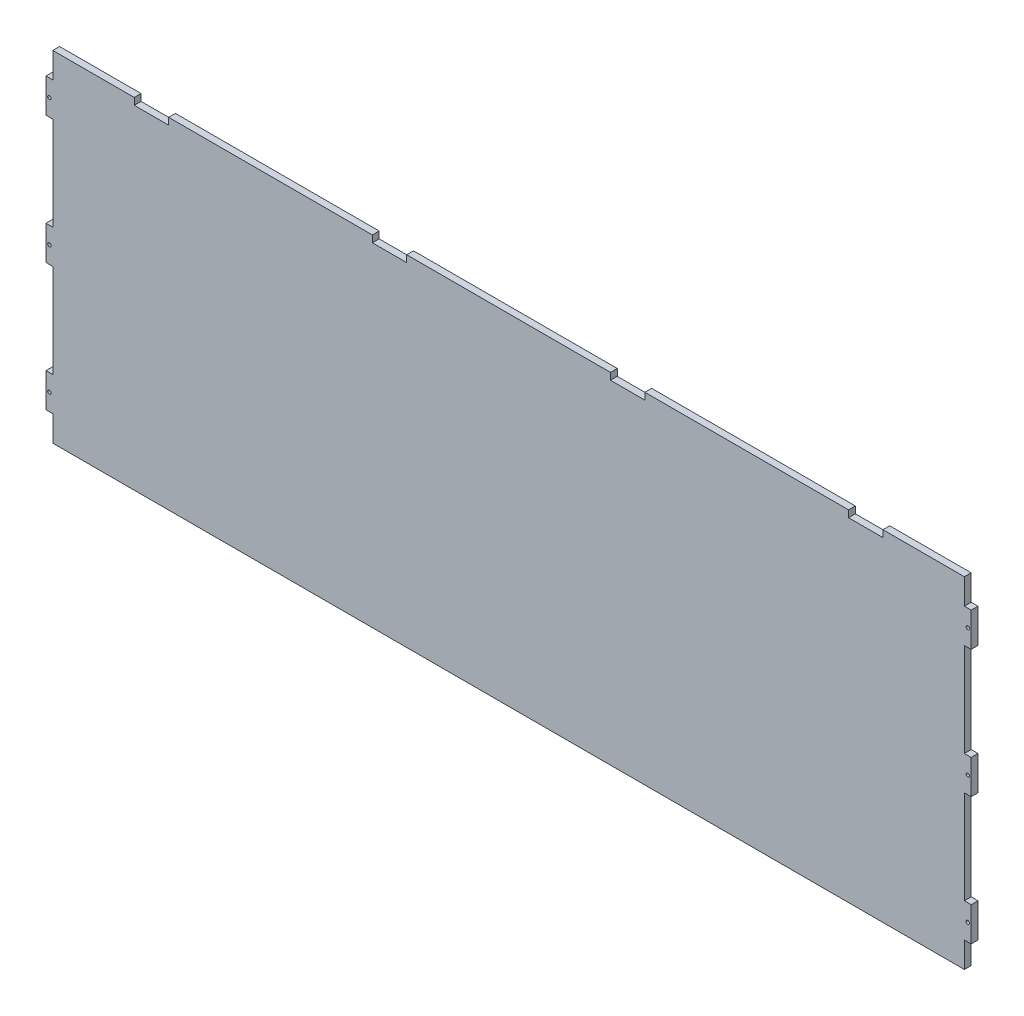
ISO-10303-21;
HEADER;
FILE_DESCRIPTION(('STEP AP214'),'2;1');
FILE_NAME('part.step','',(''),(''),'','','');
FILE_SCHEMA(('AUTOMOTIVE_DESIGN { 1 0 10303 214 1 1 1 1 }'));
ENDSEC;
DATA;
#1=APPLICATION_CONTEXT('core data for automotive mechanical design processes');
#2=APPLICATION_PROTOCOL_DEFINITION('international standard','automotive_design',2000,#1);
#3=PRODUCT_CONTEXT('',#1,'mechanical');
#4=PRODUCT('Part','Part','',(#3));
#5=PRODUCT_RELATED_PRODUCT_CATEGORY('part','',(#4));
#6=PRODUCT_DEFINITION_FORMATION('','',#4);
#7=PRODUCT_DEFINITION_CONTEXT('part definition',#1,'design');
#8=PRODUCT_DEFINITION('design','',#6,#7);
#9=PRODUCT_DEFINITION_SHAPE('','',#8);
#10=(LENGTH_UNIT() NAMED_UNIT(*) SI_UNIT(.MILLI.,.METRE.));
#11=(NAMED_UNIT(*) PLANE_ANGLE_UNIT() SI_UNIT($,.RADIAN.));
#12=(NAMED_UNIT(*) SI_UNIT($,.STERADIAN.) SOLID_ANGLE_UNIT());
#13=UNCERTAINTY_MEASURE_WITH_UNIT(LENGTH_MEASURE(1.E-05),#10,'distance_accuracy_value','');
#14=(GEOMETRIC_REPRESENTATION_CONTEXT(3) GLOBAL_UNCERTAINTY_ASSIGNED_CONTEXT((#13)) GLOBAL_UNIT_ASSIGNED_CONTEXT((#10,
#11,#12)) REPRESENTATION_CONTEXT('',''));
#15=CARTESIAN_POINT('',(0.,0.,0.));
#16=DIRECTION('',(0.,0.,1.));
#17=DIRECTION('',(1.,0.,0.));
#18=AXIS2_PLACEMENT_3D('',#15,#16,#17);
#19=CARTESIAN_POINT('',(-272.,100.,4.));
#20=DIRECTION('',(0.,-1.,0.));
#21=DIRECTION('',(0.,0.,-1.));
#22=AXIS2_PLACEMENT_3D('',#19,#20,#21);
#23=PLANE('',#22);
#24=DIRECTION('',(-1.,0.,0.));
#25=VECTOR('',#24,1.);
#26=CARTESIAN_POINT('',(-272.,100.,4.));
#27=LINE('',#26,#25);
#28=CARTESIAN_POINT('',(-220.1,100.,4.));
#29=VERTEX_POINT('',#28);
#30=CARTESIAN_POINT('',(-268.,100.,4.));
#31=VERTEX_POINT('',#30);
#32=EDGE_CURVE('E732',#29,#31,#27,.T.);
#33=ORIENTED_EDGE('',*,*,#32,.F.);
#34=DIRECTION('',(0.,0.,1.));
#35=VECTOR('',#34,1.);
#36=CARTESIAN_POINT('',(-220.1,100.,0.));
#37=LINE('',#36,#35);
#38=CARTESIAN_POINT('',(-220.1,100.,0.));
#39=VERTEX_POINT('',#38);
#40=EDGE_CURVE('E362',#39,#29,#37,.T.);
#41=ORIENTED_EDGE('',*,*,#40,.F.);
#42=DIRECTION('',(-1.,0.,0.));
#43=VECTOR('',#42,1.);
#44=CARTESIAN_POINT('',(-272.,100.,0.));
#45=LINE('',#44,#43);
#46=CARTESIAN_POINT('',(-268.,100.,0.));
#47=VERTEX_POINT('',#46);
#48=EDGE_CURVE('E343',#39,#47,#45,.T.);
#49=ORIENTED_EDGE('',*,*,#48,.T.);
#50=DIRECTION('',(0.,0.,1.));
#51=VECTOR('',#50,1.);
#52=CARTESIAN_POINT('',(-268.,100.,0.));
#53=LINE('',#52,#51);
#54=EDGE_CURVE('E494',#47,#31,#53,.T.);
#55=ORIENTED_EDGE('',*,*,#54,.T.);
#56=EDGE_LOOP('',(#33,#41,#49,#55));
#57=FACE_BOUND('',#56,.T.);
#58=ADVANCED_FACE('F38',(#57),#23,.F.);
#59=CARTESIAN_POINT('',(-80.1,100.,0.));
#60=VERTEX_POINT('',#59);
#61=CARTESIAN_POINT('',(-199.9,100.,0.));
#62=VERTEX_POINT('',#61);
#63=EDGE_CURVE('E871',#60,#62,#45,.T.);
#64=ORIENTED_EDGE('',*,*,#63,.T.);
#65=DIRECTION('',(0.,0.,1.));
#66=VECTOR('',#65,1.);
#67=CARTESIAN_POINT('',(-199.9,100.,0.));
#68=LINE('',#67,#66);
#69=CARTESIAN_POINT('',(-199.9,100.,4.));
#70=VERTEX_POINT('',#69);
#71=EDGE_CURVE('E366',#62,#70,#68,.T.);
#72=ORIENTED_EDGE('',*,*,#71,.T.);
#73=CARTESIAN_POINT('',(-80.1,100.,4.));
#74=VERTEX_POINT('',#73);
#75=EDGE_CURVE('E792',#74,#70,#27,.T.);
#76=ORIENTED_EDGE('',*,*,#75,.F.);
#77=DIRECTION('',(0.,0.,1.));
#78=VECTOR('',#77,1.);
#79=CARTESIAN_POINT('',(-80.1,100.,0.));
#80=LINE('',#79,#78);
#81=EDGE_CURVE('E359',#60,#74,#80,.T.);
#82=ORIENTED_EDGE('',*,*,#81,.F.);
#83=EDGE_LOOP('',(#64,#72,#76,#82));
#84=FACE_BOUND('',#83,.T.);
#85=ADVANCED_FACE('F869',(#84),#23,.F.);
#86=CARTESIAN_POINT('',(59.9,100.,0.));
#87=VERTEX_POINT('',#86);
#88=CARTESIAN_POINT('',(-59.9,100.,0.));
#89=VERTEX_POINT('',#88);
#90=EDGE_CURVE('E874',#87,#89,#45,.T.);
#91=ORIENTED_EDGE('',*,*,#90,.T.);
#92=DIRECTION('',(0.,0.,1.));
#93=VECTOR('',#92,1.);
#94=CARTESIAN_POINT('',(-59.9,100.,0.));
#95=LINE('',#94,#93);
#96=CARTESIAN_POINT('',(-59.9,100.,4.));
#97=VERTEX_POINT('',#96);
#98=EDGE_CURVE('E397',#89,#97,#95,.T.);
#99=ORIENTED_EDGE('',*,*,#98,.T.);
#100=CARTESIAN_POINT('',(59.9,100.,4.));
#101=VERTEX_POINT('',#100);
#102=EDGE_CURVE('E851',#101,#97,#27,.T.);
#103=ORIENTED_EDGE('',*,*,#102,.F.);
#104=DIRECTION('',(0.,0.,1.));
#105=VECTOR('',#104,1.);
#106=CARTESIAN_POINT('',(59.9,100.,0.));
#107=LINE('',#106,#105);
#108=EDGE_CURVE('E389',#87,#101,#107,.T.);
#109=ORIENTED_EDGE('',*,*,#108,.F.);
#110=EDGE_LOOP('',(#91,#99,#103,#109));
#111=FACE_BOUND('',#110,.T.);
#112=ADVANCED_FACE('F1017',(#111),#23,.F.);
#113=CARTESIAN_POINT('',(199.9,100.,0.));
#114=VERTEX_POINT('',#113);
#115=CARTESIAN_POINT('',(80.1,100.,0.));
#116=VERTEX_POINT('',#115);
#117=EDGE_CURVE('E746',#114,#116,#45,.T.);
#118=ORIENTED_EDGE('',*,*,#117,.T.);
#119=DIRECTION('',(0.,0.,1.));
#120=VECTOR('',#119,1.);
#121=CARTESIAN_POINT('',(80.1,100.,0.));
#122=LINE('',#121,#120);
#123=CARTESIAN_POINT('',(80.1,100.,4.));
#124=VERTEX_POINT('',#123);
#125=EDGE_CURVE('E433',#116,#124,#122,.T.);
#126=ORIENTED_EDGE('',*,*,#125,.T.);
#127=CARTESIAN_POINT('',(199.9,100.,4.));
#128=VERTEX_POINT('',#127);
#129=EDGE_CURVE('E731',#128,#124,#27,.T.);
#130=ORIENTED_EDGE('',*,*,#129,.F.);
#131=DIRECTION('',(0.,0.,1.));
#132=VECTOR('',#131,1.);
#133=CARTESIAN_POINT('',(199.9,100.,0.));
#134=LINE('',#133,#132);
#135=EDGE_CURVE('E425',#114,#128,#134,.T.);
#136=ORIENTED_EDGE('',*,*,#135,.F.);
#137=EDGE_LOOP('',(#118,#126,#130,#136));
#138=FACE_BOUND('',#137,.T.);
#139=ADVANCED_FACE('F848',(#138),#23,.F.);
#140=CARTESIAN_POINT('',(268.,100.,0.));
#141=VERTEX_POINT('',#140);
#142=CARTESIAN_POINT('',(220.1,100.,0.));
#143=VERTEX_POINT('',#142);
#144=EDGE_CURVE('E742',#141,#143,#45,.T.);
#145=ORIENTED_EDGE('',*,*,#144,.T.);
#146=DIRECTION('',(0.,0.,1.));
#147=VECTOR('',#146,1.);
#148=CARTESIAN_POINT('',(220.1,100.,0.));
#149=LINE('',#148,#147);
#150=CARTESIAN_POINT('',(220.1,100.,4.));
#151=VERTEX_POINT('',#150);
#152=EDGE_CURVE('E468',#143,#151,#149,.T.);
#153=ORIENTED_EDGE('',*,*,#152,.T.);
#154=CARTESIAN_POINT('',(268.,100.,4.));
#155=VERTEX_POINT('',#154);
#156=EDGE_CURVE('E726',#155,#151,#27,.T.);
#157=ORIENTED_EDGE('',*,*,#156,.F.);
#158=DIRECTION('',(0.,0.,1.));
#159=VECTOR('',#158,1.);
#160=CARTESIAN_POINT('',(268.,100.,0.));
#161=LINE('',#160,#159);
#162=EDGE_CURVE('E606',#141,#155,#161,.T.);
#163=ORIENTED_EDGE('',*,*,#162,.F.);
#164=EDGE_LOOP('',(#145,#153,#157,#163));
#165=FACE_BOUND('',#164,.T.);
#166=ADVANCED_FACE('F830',(#165),#23,.F.);
#167=CARTESIAN_POINT('',(-272.,-100.,4.));
#168=DIRECTION('',(1.,0.,0.));
#169=DIRECTION('',(0.,0.,-1.));
#170=AXIS2_PLACEMENT_3D('',#167,#168,#169);
#171=PLANE('',#170);
#172=DIRECTION('',(0.,0.,1.));
#173=VECTOR('',#172,1.);
#174=CARTESIAN_POINT('',(-272.,85.,0.));
#175=LINE('',#174,#173);
#176=CARTESIAN_POINT('',(-272.,85.,0.));
#177=VERTEX_POINT('',#176);
#178=CARTESIAN_POINT('',(-272.,85.,4.));
#179=VERTEX_POINT('',#178);
#180=EDGE_CURVE('E485',#177,#179,#175,.T.);
#181=ORIENTED_EDGE('',*,*,#180,.F.);
#182=DIRECTION('',(0.,-1.,0.));
#183=VECTOR('',#182,1.);
#184=CARTESIAN_POINT('',(-272.,-100.,0.));
#185=LINE('',#184,#183);
#186=CARTESIAN_POINT('',(-272.,65.,0.));
#187=VERTEX_POINT('',#186);
#188=EDGE_CURVE('E750',#177,#187,#185,.T.);
#189=ORIENTED_EDGE('',*,*,#188,.T.);
#190=DIRECTION('',(0.,0.,1.));
#191=VECTOR('',#190,1.);
#192=CARTESIAN_POINT('',(-272.,65.,0.));
#193=LINE('',#192,#191);
#194=CARTESIAN_POINT('',(-272.,65.,4.));
#195=VERTEX_POINT('',#194);
#196=EDGE_CURVE('E490',#187,#195,#193,.T.);
#197=ORIENTED_EDGE('',*,*,#196,.T.);
#198=DIRECTION('',(0.,-1.,0.));
#199=VECTOR('',#198,1.);
#200=CARTESIAN_POINT('',(-272.,-100.,4.));
#201=LINE('',#200,#199);
#202=EDGE_CURVE('E48',#179,#195,#201,.T.);
#203=ORIENTED_EDGE('',*,*,#202,.F.);
#204=EDGE_LOOP('',(#181,#189,#197,#203));
#205=FACE_BOUND('',#204,.T.);
#206=ADVANCED_FACE('F971',(#205),#171,.F.);
#207=DIRECTION('',(0.,0.,1.));
#208=VECTOR('',#207,1.);
#209=CARTESIAN_POINT('',(-272.,10.,0.));
#210=LINE('',#209,#208);
#211=CARTESIAN_POINT('',(-272.,10.,0.));
#212=VERTEX_POINT('',#211);
#213=CARTESIAN_POINT('',(-272.,10.,4.));
#214=VERTEX_POINT('',#213);
#215=EDGE_CURVE('E515',#212,#214,#210,.T.);
#216=ORIENTED_EDGE('',*,*,#215,.F.);
#217=CARTESIAN_POINT('',(-272.,-10.,0.));
#218=VERTEX_POINT('',#217);
#219=EDGE_CURVE('E749',#212,#218,#185,.T.);
#220=ORIENTED_EDGE('',*,*,#219,.T.);
#221=DIRECTION('',(0.,0.,1.));
#222=VECTOR('',#221,1.);
#223=CARTESIAN_POINT('',(-272.,-10.,0.));
#224=LINE('',#223,#222);
#225=CARTESIAN_POINT('',(-272.,-10.,4.));
#226=VERTEX_POINT('',#225);
#227=EDGE_CURVE('E521',#218,#226,#224,.T.);
#228=ORIENTED_EDGE('',*,*,#227,.T.);
#229=EDGE_CURVE('E735',#214,#226,#201,.T.);
#230=ORIENTED_EDGE('',*,*,#229,.F.);
#231=EDGE_LOOP('',(#216,#220,#228,#230));
#232=FACE_BOUND('',#231,.T.);
#233=ADVANCED_FACE('F982',(#232),#171,.F.);
#234=DIRECTION('',(0.,0.,1.));
#235=VECTOR('',#234,1.);
#236=CARTESIAN_POINT('',(-272.,-65.,0.));
#237=LINE('',#236,#235);
#238=CARTESIAN_POINT('',(-272.,-65.,0.));
#239=VERTEX_POINT('',#238);
#240=CARTESIAN_POINT('',(-272.,-65.,4.));
#241=VERTEX_POINT('',#240);
#242=EDGE_CURVE('E550',#239,#241,#237,.T.);
#243=ORIENTED_EDGE('',*,*,#242,.F.);
#244=CARTESIAN_POINT('',(-272.,-85.,0.));
#245=VERTEX_POINT('',#244);
#246=EDGE_CURVE('E745',#239,#245,#185,.T.);
#247=ORIENTED_EDGE('',*,*,#246,.T.);
#248=DIRECTION('',(0.,0.,1.));
#249=VECTOR('',#248,1.);
#250=CARTESIAN_POINT('',(-272.,-85.,0.));
#251=LINE('',#250,#249);
#252=CARTESIAN_POINT('',(-272.,-85.,4.));
#253=VERTEX_POINT('',#252);
#254=EDGE_CURVE('E556',#245,#253,#251,.T.);
#255=ORIENTED_EDGE('',*,*,#254,.T.);
#256=EDGE_CURVE('E730',#241,#253,#201,.T.);
#257=ORIENTED_EDGE('',*,*,#256,.F.);
#258=EDGE_LOOP('',(#243,#247,#255,#257));
#259=FACE_BOUND('',#258,.T.);
#260=ADVANCED_FACE('F997',(#259),#171,.F.);
#261=CARTESIAN_POINT('',(-272.,-100.,4.));
#262=DIRECTION('',(0.,1.,0.));
#263=DIRECTION('',(0.,0.,1.));
#264=AXIS2_PLACEMENT_3D('',#261,#262,#263);
#265=PLANE('',#264);
#266=DIRECTION('',(0.,0.,1.));
#267=VECTOR('',#266,1.);
#268=CARTESIAN_POINT('',(-268.,-100.,0.));
#269=LINE('',#268,#267);
#270=CARTESIAN_POINT('',(-268.,-100.,0.));
#271=VERTEX_POINT('',#270);
#272=CARTESIAN_POINT('',(-268.,-100.,4.));
#273=VERTEX_POINT('',#272);
#274=EDGE_CURVE('E582',#271,#273,#269,.T.);
#275=ORIENTED_EDGE('',*,*,#274,.F.);
#276=DIRECTION('',(1.,0.,0.));
#277=VECTOR('',#276,1.);
#278=CARTESIAN_POINT('',(-272.,-100.,0.));
#279=LINE('',#278,#277);
#280=CARTESIAN_POINT('',(268.,-100.,0.));
#281=VERTEX_POINT('',#280);
#282=EDGE_CURVE('E42',#271,#281,#279,.T.);
#283=ORIENTED_EDGE('',*,*,#282,.T.);
#284=DIRECTION('',(0.,0.,1.));
#285=VECTOR('',#284,1.);
#286=CARTESIAN_POINT('',(268.,-100.,0.));
#287=LINE('',#286,#285);
#288=CARTESIAN_POINT('',(268.,-100.,4.));
#289=VERTEX_POINT('',#288);
#290=EDGE_CURVE('E679',#281,#289,#287,.T.);
#291=ORIENTED_EDGE('',*,*,#290,.T.);
#292=DIRECTION('',(1.,0.,0.));
#293=VECTOR('',#292,1.);
#294=CARTESIAN_POINT('',(-272.,-100.,4.));
#295=LINE('',#294,#293);
#296=EDGE_CURVE('E11',#273,#289,#295,.T.);
#297=ORIENTED_EDGE('',*,*,#296,.F.);
#298=EDGE_LOOP('',(#275,#283,#291,#297));
#299=FACE_BOUND('',#298,.T.);
#300=ADVANCED_FACE('F769',(#299),#265,.F.);
#301=CARTESIAN_POINT('',(0.,0.,4.));
#302=DIRECTION('',(0.,0.,-1.));
#303=DIRECTION('',(-1.,0.,0.));
#304=AXIS2_PLACEMENT_3D('',#301,#302,#303);
#305=PLANE('',#304);
#306=CARTESIAN_POINT('',(-270.,75.,4.));
#307=DIRECTION('',(0.,0.,1.));
#308=DIRECTION('',(1.,0.,0.));
#309=AXIS2_PLACEMENT_3D('',#306,#307,#308);
#310=CIRCLE('',#309,1.);
#311=CARTESIAN_POINT('',(-269.,75.,4.));
#312=VERTEX_POINT('',#311);
#313=EDGE_CURVE('E1616',#312,#312,#310,.T.);
#314=ORIENTED_EDGE('',*,*,#313,.F.);
#315=EDGE_LOOP('',(#314));
#316=FACE_BOUND('',#315,.T.);
#317=CARTESIAN_POINT('',(-270.,0.,4.));
#318=DIRECTION('',(0.,0.,1.));
#319=DIRECTION('',(1.,0.,0.));
#320=AXIS2_PLACEMENT_3D('',#317,#318,#319);
#321=CIRCLE('',#320,1.);
#322=CARTESIAN_POINT('',(-269.,0.,4.));
#323=VERTEX_POINT('',#322);
#324=EDGE_CURVE('E1610',#323,#323,#321,.T.);
#325=ORIENTED_EDGE('',*,*,#324,.F.);
#326=EDGE_LOOP('',(#325));
#327=FACE_BOUND('',#326,.T.);
#328=CARTESIAN_POINT('',(-270.,-75.,4.));
#329=DIRECTION('',(0.,0.,1.));
#330=DIRECTION('',(1.,0.,0.));
#331=AXIS2_PLACEMENT_3D('',#328,#329,#330);
#332=CIRCLE('',#331,1.);
#333=CARTESIAN_POINT('',(-269.,-75.,4.));
#334=VERTEX_POINT('',#333);
#335=EDGE_CURVE('E1604',#334,#334,#332,.T.);
#336=ORIENTED_EDGE('',*,*,#335,.F.);
#337=EDGE_LOOP('',(#336));
#338=FACE_BOUND('',#337,.T.);
#339=CARTESIAN_POINT('',(270.,75.,4.));
#340=DIRECTION('',(0.,0.,1.));
#341=DIRECTION('',(1.,0.,0.));
#342=AXIS2_PLACEMENT_3D('',#339,#340,#341);
#343=CIRCLE('',#342,1.);
#344=CARTESIAN_POINT('',(271.,75.,4.));
#345=VERTEX_POINT('',#344);
#346=EDGE_CURVE('E1598',#345,#345,#343,.T.);
#347=ORIENTED_EDGE('',*,*,#346,.F.);
#348=EDGE_LOOP('',(#347));
#349=FACE_BOUND('',#348,.T.);
#350=CARTESIAN_POINT('',(270.,0.,4.));
#351=DIRECTION('',(0.,0.,1.));
#352=DIRECTION('',(1.,0.,0.));
#353=AXIS2_PLACEMENT_3D('',#350,#351,#352);
#354=CIRCLE('',#353,1.);
#355=CARTESIAN_POINT('',(271.,0.,4.));
#356=VERTEX_POINT('',#355);
#357=EDGE_CURVE('E1590',#356,#356,#354,.T.);
#358=ORIENTED_EDGE('',*,*,#357,.F.);
#359=EDGE_LOOP('',(#358));
#360=FACE_BOUND('',#359,.T.);
#361=CARTESIAN_POINT('',(270.,-75.,4.));
#362=DIRECTION('',(0.,0.,1.));
#363=DIRECTION('',(1.,0.,0.));
#364=AXIS2_PLACEMENT_3D('',#361,#362,#363);
#365=CIRCLE('',#364,1.);
#366=CARTESIAN_POINT('',(271.,-75.,4.));
#367=VERTEX_POINT('',#366);
#368=EDGE_CURVE('E1582',#367,#367,#365,.T.);
#369=ORIENTED_EDGE('',*,*,#368,.F.);
#370=EDGE_LOOP('',(#369));
#371=FACE_BOUND('',#370,.T.);
#372=DIRECTION('',(1.,0.,0.));
#373=VECTOR('',#372,1.);
#374=CARTESIAN_POINT('',(-220.1,96.,4.));
#375=LINE('',#374,#373);
#376=CARTESIAN_POINT('',(-220.1,96.,4.));
#377=VERTEX_POINT('',#376);
#378=CARTESIAN_POINT('',(-199.9,96.,4.));
#379=VERTEX_POINT('',#378);
#380=EDGE_CURVE('E349',#377,#379,#375,.T.);
#381=ORIENTED_EDGE('',*,*,#380,.F.);
#382=DIRECTION('',(0.,-1.,0.));
#383=VECTOR('',#382,1.);
#384=CARTESIAN_POINT('',(-220.1,100.,4.));
#385=LINE('',#384,#383);
#386=EDGE_CURVE('E327',#29,#377,#385,.T.);
#387=ORIENTED_EDGE('',*,*,#386,.F.);
#388=ORIENTED_EDGE('',*,*,#32,.T.);
#389=DIRECTION('',(0.,-1.,0.));
#390=VECTOR('',#389,1.);
#391=CARTESIAN_POINT('',(-268.,100.,4.));
#392=LINE('',#391,#390);
#393=CARTESIAN_POINT('',(-268.,85.,4.));
#394=VERTEX_POINT('',#393);
#395=EDGE_CURVE('E481',#31,#394,#392,.T.);
#396=ORIENTED_EDGE('',*,*,#395,.T.);
#397=DIRECTION('',(-1.,0.,0.));
#398=VECTOR('',#397,1.);
#399=CARTESIAN_POINT('',(-272.,85.,4.));
#400=LINE('',#399,#398);
#401=EDGE_CURVE('E486',#394,#179,#400,.T.);
#402=ORIENTED_EDGE('',*,*,#401,.T.);
#403=ORIENTED_EDGE('',*,*,#202,.T.);
#404=DIRECTION('',(1.,0.,0.));
#405=VECTOR('',#404,1.);
#406=CARTESIAN_POINT('',(-272.,65.,4.));
#407=LINE('',#406,#405);
#408=CARTESIAN_POINT('',(-268.,65.,4.));
#409=VERTEX_POINT('',#408);
#410=EDGE_CURVE('E508',#195,#409,#407,.T.);
#411=ORIENTED_EDGE('',*,*,#410,.T.);
#412=DIRECTION('',(0.,-1.,0.));
#413=VECTOR('',#412,1.);
#414=CARTESIAN_POINT('',(-268.,65.,4.));
#415=LINE('',#414,#413);
#416=CARTESIAN_POINT('',(-268.,10.,4.));
#417=VERTEX_POINT('',#416);
#418=EDGE_CURVE('E520',#409,#417,#415,.T.);
#419=ORIENTED_EDGE('',*,*,#418,.T.);
#420=DIRECTION('',(-1.,0.,0.));
#421=VECTOR('',#420,1.);
#422=CARTESIAN_POINT('',(-272.,10.,4.));
#423=LINE('',#422,#421);
#424=EDGE_CURVE('E516',#417,#214,#423,.T.);
#425=ORIENTED_EDGE('',*,*,#424,.T.);
#426=ORIENTED_EDGE('',*,*,#229,.T.);
#427=DIRECTION('',(1.,0.,0.));
#428=VECTOR('',#427,1.);
#429=CARTESIAN_POINT('',(-272.,-10.,4.));
#430=LINE('',#429,#428);
#431=CARTESIAN_POINT('',(-268.,-10.,4.));
#432=VERTEX_POINT('',#431);
#433=EDGE_CURVE('E543',#226,#432,#430,.T.);
#434=ORIENTED_EDGE('',*,*,#433,.T.);
#435=DIRECTION('',(0.,-1.,0.));
#436=VECTOR('',#435,1.);
#437=CARTESIAN_POINT('',(-268.,-10.,4.));
#438=LINE('',#437,#436);
#439=CARTESIAN_POINT('',(-268.,-65.,4.));
#440=VERTEX_POINT('',#439);
#441=EDGE_CURVE('E555',#432,#440,#438,.T.);
#442=ORIENTED_EDGE('',*,*,#441,.T.);
#443=DIRECTION('',(-1.,0.,0.));
#444=VECTOR('',#443,1.);
#445=CARTESIAN_POINT('',(-272.,-65.,4.));
#446=LINE('',#445,#444);
#447=EDGE_CURVE('E551',#440,#241,#446,.T.);
#448=ORIENTED_EDGE('',*,*,#447,.T.);
#449=ORIENTED_EDGE('',*,*,#256,.T.);
#450=DIRECTION('',(1.,0.,0.));
#451=VECTOR('',#450,1.);
#452=CARTESIAN_POINT('',(-272.,-85.,4.));
#453=LINE('',#452,#451);
#454=CARTESIAN_POINT('',(-268.,-85.,4.));
#455=VERTEX_POINT('',#454);
#456=EDGE_CURVE('E578',#253,#455,#453,.T.);
#457=ORIENTED_EDGE('',*,*,#456,.T.);
#458=DIRECTION('',(0.,-1.,0.));
#459=VECTOR('',#458,1.);
#460=CARTESIAN_POINT('',(-268.,-100.,4.));
#461=LINE('',#460,#459);
#462=EDGE_CURVE('E365',#455,#273,#461,.T.);
#463=ORIENTED_EDGE('',*,*,#462,.T.);
#464=ORIENTED_EDGE('',*,*,#296,.T.);
#465=DIRECTION('',(0.,-1.,0.));
#466=VECTOR('',#465,1.);
#467=CARTESIAN_POINT('',(268.,-100.,4.));
#468=LINE('',#467,#466);
#469=CARTESIAN_POINT('',(268.,-85.,4.));
#470=VERTEX_POINT('',#469);
#471=EDGE_CURVE('E701',#470,#289,#468,.T.);
#472=ORIENTED_EDGE('',*,*,#471,.F.);
#473=DIRECTION('',(-1.,0.,0.));
#474=VECTOR('',#473,1.);
#475=CARTESIAN_POINT('',(272.,-85.,4.));
#476=LINE('',#475,#474);
#477=CARTESIAN_POINT('',(272.,-85.,4.));
#478=VERTEX_POINT('',#477);
#479=EDGE_CURVE('E498',#478,#470,#476,.T.);
#480=ORIENTED_EDGE('',*,*,#479,.F.);
#481=DIRECTION('',(0.,1.,0.));
#482=VECTOR('',#481,1.);
#483=CARTESIAN_POINT('',(272.,-100.,4.));
#484=LINE('',#483,#482);
#485=CARTESIAN_POINT('',(272.,-65.,4.));
#486=VERTEX_POINT('',#485);
#487=EDGE_CURVE('E725',#478,#486,#484,.T.);
#488=ORIENTED_EDGE('',*,*,#487,.T.);
#489=DIRECTION('',(1.,0.,0.));
#490=VECTOR('',#489,1.);
#491=CARTESIAN_POINT('',(272.,-65.,4.));
#492=LINE('',#491,#490);
#493=CARTESIAN_POINT('',(268.,-65.,4.));
#494=VERTEX_POINT('',#493);
#495=EDGE_CURVE('E665',#494,#486,#492,.T.);
#496=ORIENTED_EDGE('',*,*,#495,.F.);
#497=DIRECTION('',(0.,-1.,0.));
#498=VECTOR('',#497,1.);
#499=CARTESIAN_POINT('',(268.,-10.,4.));
#500=LINE('',#499,#498);
#501=CARTESIAN_POINT('',(268.,-10.,4.));
#502=VERTEX_POINT('',#501);
#503=EDGE_CURVE('E678',#502,#494,#500,.T.);
#504=ORIENTED_EDGE('',*,*,#503,.F.);
#505=DIRECTION('',(-1.,0.,0.));
#506=VECTOR('',#505,1.);
#507=CARTESIAN_POINT('',(272.,-10.,4.));
#508=LINE('',#507,#506);
#509=CARTESIAN_POINT('',(272.,-10.,4.));
#510=VERTEX_POINT('',#509);
#511=EDGE_CURVE('E674',#510,#502,#508,.T.);
#512=ORIENTED_EDGE('',*,*,#511,.F.);
#513=CARTESIAN_POINT('',(272.,10.,4.));
#514=VERTEX_POINT('',#513);
#515=EDGE_CURVE('E724',#510,#514,#484,.T.);
#516=ORIENTED_EDGE('',*,*,#515,.T.);
#517=DIRECTION('',(1.,0.,0.));
#518=VECTOR('',#517,1.);
#519=CARTESIAN_POINT('',(272.,10.,4.));
#520=LINE('',#519,#518);
#521=CARTESIAN_POINT('',(268.,10.,4.));
#522=VERTEX_POINT('',#521);
#523=EDGE_CURVE('E629',#522,#514,#520,.T.);
#524=ORIENTED_EDGE('',*,*,#523,.F.);
#525=DIRECTION('',(0.,-1.,0.));
#526=VECTOR('',#525,1.);
#527=CARTESIAN_POINT('',(268.,65.,4.));
#528=LINE('',#527,#526);
#529=CARTESIAN_POINT('',(268.,65.,4.));
#530=VERTEX_POINT('',#529);
#531=EDGE_CURVE('E642',#530,#522,#528,.T.);
#532=ORIENTED_EDGE('',*,*,#531,.F.);
#533=DIRECTION('',(-1.,0.,0.));
#534=VECTOR('',#533,1.);
#535=CARTESIAN_POINT('',(272.,65.,4.));
#536=LINE('',#535,#534);
#537=CARTESIAN_POINT('',(272.,65.,4.));
#538=VERTEX_POINT('',#537);
#539=EDGE_CURVE('E638',#538,#530,#536,.T.);
#540=ORIENTED_EDGE('',*,*,#539,.F.);
#541=CARTESIAN_POINT('',(272.,85.,4.));
#542=VERTEX_POINT('',#541);
#543=EDGE_CURVE('E720',#538,#542,#484,.T.);
#544=ORIENTED_EDGE('',*,*,#543,.T.);
#545=DIRECTION('',(1.,0.,0.));
#546=VECTOR('',#545,1.);
#547=CARTESIAN_POINT('',(272.,85.,4.));
#548=LINE('',#547,#546);
#549=CARTESIAN_POINT('',(268.,85.,4.));
#550=VERTEX_POINT('',#549);
#551=EDGE_CURVE('E602',#550,#542,#548,.T.);
#552=ORIENTED_EDGE('',*,*,#551,.F.);
#553=DIRECTION('',(0.,-1.,0.));
#554=VECTOR('',#553,1.);
#555=CARTESIAN_POINT('',(268.,100.,4.));
#556=LINE('',#555,#554);
#557=EDGE_CURVE('E607',#155,#550,#556,.T.);
#558=ORIENTED_EDGE('',*,*,#557,.F.);
#559=ORIENTED_EDGE('',*,*,#156,.T.);
#560=DIRECTION('',(0.,1.,0.));
#561=VECTOR('',#560,1.);
#562=CARTESIAN_POINT('',(220.1,100.,4.));
#563=LINE('',#562,#561);
#564=CARTESIAN_POINT('',(220.1,96.,4.));
#565=VERTEX_POINT('',#564);
#566=EDGE_CURVE('E447',#565,#151,#563,.T.);
#567=ORIENTED_EDGE('',*,*,#566,.F.);
#568=DIRECTION('',(1.,0.,0.));
#569=VECTOR('',#568,1.);
#570=CARTESIAN_POINT('',(199.9,96.,4.));
#571=LINE('',#570,#569);
#572=CARTESIAN_POINT('',(199.9,96.,4.));
#573=VERTEX_POINT('',#572);
#574=EDGE_CURVE('E460',#573,#565,#571,.T.);
#575=ORIENTED_EDGE('',*,*,#574,.F.);
#576=DIRECTION('',(0.,-1.,0.));
#577=VECTOR('',#576,1.);
#578=CARTESIAN_POINT('',(199.9,100.,4.));
#579=LINE('',#578,#577);
#580=EDGE_CURVE('E456',#128,#573,#579,.T.);
#581=ORIENTED_EDGE('',*,*,#580,.F.);
#582=ORIENTED_EDGE('',*,*,#129,.T.);
#583=DIRECTION('',(0.,1.,0.));
#584=VECTOR('',#583,1.);
#585=CARTESIAN_POINT('',(80.1,100.,4.));
#586=LINE('',#585,#584);
#587=CARTESIAN_POINT('',(80.1,96.,4.));
#588=VERTEX_POINT('',#587);
#589=EDGE_CURVE('E411',#588,#124,#586,.T.);
#590=ORIENTED_EDGE('',*,*,#589,.F.);
#591=DIRECTION('',(1.,0.,0.));
#592=VECTOR('',#591,1.);
#593=CARTESIAN_POINT('',(59.9,96.,4.));
#594=LINE('',#593,#592);
#595=CARTESIAN_POINT('',(59.9,96.,4.));
#596=VERTEX_POINT('',#595);
#597=EDGE_CURVE('E424',#596,#588,#594,.T.);
#598=ORIENTED_EDGE('',*,*,#597,.F.);
#599=DIRECTION('',(0.,-1.,0.));
#600=VECTOR('',#599,1.);
#601=CARTESIAN_POINT('',(59.9,100.,4.));
#602=LINE('',#601,#600);
#603=EDGE_CURVE('E420',#101,#596,#602,.T.);
#604=ORIENTED_EDGE('',*,*,#603,.F.);
#605=ORIENTED_EDGE('',*,*,#102,.T.);
#606=DIRECTION('',(0.,1.,0.));
#607=VECTOR('',#606,1.);
#608=CARTESIAN_POINT('',(-59.9,100.,4.));
#609=LINE('',#608,#607);
#610=CARTESIAN_POINT('',(-59.9,96.,4.));
#611=VERTEX_POINT('',#610);
#612=EDGE_CURVE('E377',#611,#97,#609,.T.);
#613=ORIENTED_EDGE('',*,*,#612,.F.);
#614=DIRECTION('',(1.,0.,0.));
#615=VECTOR('',#614,1.);
#616=CARTESIAN_POINT('',(-80.1,96.,4.));
#617=LINE('',#616,#615);
#618=CARTESIAN_POINT('',(-80.1,96.,4.));
#619=VERTEX_POINT('',#618);
#620=EDGE_CURVE('E388',#619,#611,#617,.T.);
#621=ORIENTED_EDGE('',*,*,#620,.F.);
#622=DIRECTION('',(0.,-1.,0.));
#623=VECTOR('',#622,1.);
#624=CARTESIAN_POINT('',(-80.1,100.,4.));
#625=LINE('',#624,#623);
#626=EDGE_CURVE('E384',#74,#619,#625,.T.);
#627=ORIENTED_EDGE('',*,*,#626,.F.);
#628=ORIENTED_EDGE('',*,*,#75,.T.);
#629=DIRECTION('',(0.,1.,0.));
#630=VECTOR('',#629,1.);
#631=CARTESIAN_POINT('',(-199.9,100.,4.));
#632=LINE('',#631,#630);
#633=EDGE_CURVE('E345',#379,#70,#632,.T.);
#634=ORIENTED_EDGE('',*,*,#633,.F.);
#635=EDGE_LOOP('',(#381,#387,#388,#396,#402,#403,#411,#419,#425,#426,#434,#442,#448,#449,#457,
#463,#464,#472,#480,#488,#496,#504,#512,#516,#524,#532,#540,#544,#552,#558,#559,#567,#575,#581,
#582,#590,#598,#604,#605,#613,#621,#627,#628,#634));
#636=FACE_BOUND('',#635,.T.);
#637=ADVANCED_FACE('F798',(#316,#327,#338,#349,#360,#371,#636),#305,.F.);
#638=CARTESIAN_POINT('',(0.,0.,0.));
#639=DIRECTION('',(0.,0.,-1.));
#640=DIRECTION('',(-1.,0.,0.));
#641=AXIS2_PLACEMENT_3D('',#638,#639,#640);
#642=PLANE('',#641);
#643=CARTESIAN_POINT('',(-270.,75.,0.));
#644=DIRECTION('',(0.,0.,1.));
#645=DIRECTION('',(1.,0.,0.));
#646=AXIS2_PLACEMENT_3D('',#643,#644,#645);
#647=CIRCLE('',#646,1.);
#648=CARTESIAN_POINT('',(-269.,75.,0.));
#649=VERTEX_POINT('',#648);
#650=EDGE_CURVE('E1562',#649,#649,#647,.T.);
#651=ORIENTED_EDGE('',*,*,#650,.T.);
#652=EDGE_LOOP('',(#651));
#653=FACE_BOUND('',#652,.T.);
#654=CARTESIAN_POINT('',(-270.,0.,0.));
#655=DIRECTION('',(0.,0.,1.));
#656=DIRECTION('',(1.,0.,0.));
#657=AXIS2_PLACEMENT_3D('',#654,#655,#656);
#658=CIRCLE('',#657,1.);
#659=CARTESIAN_POINT('',(-269.,0.,0.));
#660=VERTEX_POINT('',#659);
#661=EDGE_CURVE('E1566',#660,#660,#658,.T.);
#662=ORIENTED_EDGE('',*,*,#661,.T.);
#663=EDGE_LOOP('',(#662));
#664=FACE_BOUND('',#663,.T.);
#665=CARTESIAN_POINT('',(-270.,-75.,0.));
#666=DIRECTION('',(0.,0.,1.));
#667=DIRECTION('',(1.,0.,0.));
#668=AXIS2_PLACEMENT_3D('',#665,#666,#667);
#669=CIRCLE('',#668,1.);
#670=CARTESIAN_POINT('',(-269.,-75.,0.));
#671=VERTEX_POINT('',#670);
#672=EDGE_CURVE('E1570',#671,#671,#669,.T.);
#673=ORIENTED_EDGE('',*,*,#672,.T.);
#674=EDGE_LOOP('',(#673));
#675=FACE_BOUND('',#674,.T.);
#676=CARTESIAN_POINT('',(270.,75.,0.));
#677=DIRECTION('',(0.,0.,1.));
#678=DIRECTION('',(1.,0.,0.));
#679=AXIS2_PLACEMENT_3D('',#676,#677,#678);
#680=CIRCLE('',#679,1.);
#681=CARTESIAN_POINT('',(271.,75.,0.));
#682=VERTEX_POINT('',#681);
#683=EDGE_CURVE('E1574',#682,#682,#680,.T.);
#684=ORIENTED_EDGE('',*,*,#683,.T.);
#685=EDGE_LOOP('',(#684));
#686=FACE_BOUND('',#685,.T.);
#687=CARTESIAN_POINT('',(270.,0.,0.));
#688=DIRECTION('',(0.,0.,1.));
#689=DIRECTION('',(1.,0.,0.));
#690=AXIS2_PLACEMENT_3D('',#687,#688,#689);
#691=CIRCLE('',#690,1.);
#692=CARTESIAN_POINT('',(271.,0.,0.));
#693=VERTEX_POINT('',#692);
#694=EDGE_CURVE('E1578',#693,#693,#691,.T.);
#695=ORIENTED_EDGE('',*,*,#694,.T.);
#696=EDGE_LOOP('',(#695));
#697=FACE_BOUND('',#696,.T.);
#698=CARTESIAN_POINT('',(270.,-75.,0.));
#699=DIRECTION('',(0.,0.,1.));
#700=DIRECTION('',(1.,0.,0.));
#701=AXIS2_PLACEMENT_3D('',#698,#699,#700);
#702=CIRCLE('',#701,1.);
#703=CARTESIAN_POINT('',(271.,-75.,0.));
#704=VERTEX_POINT('',#703);
#705=EDGE_CURVE('E352',#704,#704,#702,.T.);
#706=ORIENTED_EDGE('',*,*,#705,.T.);
#707=EDGE_LOOP('',(#706));
#708=FACE_BOUND('',#707,.T.);
#709=DIRECTION('',(0.,-1.,0.));
#710=VECTOR('',#709,1.);
#711=CARTESIAN_POINT('',(-220.1,100.,0.));
#712=LINE('',#711,#710);
#713=CARTESIAN_POINT('',(-220.1,96.,0.));
#714=VERTEX_POINT('',#713);
#715=EDGE_CURVE('E324',#39,#714,#712,.T.);
#716=ORIENTED_EDGE('',*,*,#715,.T.);
#717=DIRECTION('',(1.,0.,0.));
#718=VECTOR('',#717,1.);
#719=CARTESIAN_POINT('',(-220.1,96.,0.));
#720=LINE('',#719,#718);
#721=CARTESIAN_POINT('',(-199.9,96.,0.));
#722=VERTEX_POINT('',#721);
#723=EDGE_CURVE('E335',#714,#722,#720,.T.);
#724=ORIENTED_EDGE('',*,*,#723,.T.);
#725=DIRECTION('',(0.,1.,0.));
#726=VECTOR('',#725,1.);
#727=CARTESIAN_POINT('',(-199.9,100.,0.));
#728=LINE('',#727,#726);
#729=EDGE_CURVE('E56',#722,#62,#728,.T.);
#730=ORIENTED_EDGE('',*,*,#729,.T.);
#731=ORIENTED_EDGE('',*,*,#63,.F.);
#732=DIRECTION('',(0.,-1.,0.));
#733=VECTOR('',#732,1.);
#734=CARTESIAN_POINT('',(-80.1,100.,0.));
#735=LINE('',#734,#733);
#736=CARTESIAN_POINT('',(-80.1,96.,0.));
#737=VERTEX_POINT('',#736);
#738=EDGE_CURVE('E372',#60,#737,#735,.T.);
#739=ORIENTED_EDGE('',*,*,#738,.T.);
#740=DIRECTION('',(1.,0.,0.));
#741=VECTOR('',#740,1.);
#742=CARTESIAN_POINT('',(-80.1,96.,0.));
#743=LINE('',#742,#741);
#744=CARTESIAN_POINT('',(-59.9,96.,0.));
#745=VERTEX_POINT('',#744);
#746=EDGE_CURVE('E376',#737,#745,#743,.T.);
#747=ORIENTED_EDGE('',*,*,#746,.T.);
#748=DIRECTION('',(0.,1.,0.));
#749=VECTOR('',#748,1.);
#750=CARTESIAN_POINT('',(-59.9,100.,0.));
#751=LINE('',#750,#749);
#752=EDGE_CURVE('E64',#745,#89,#751,.T.);
#753=ORIENTED_EDGE('',*,*,#752,.T.);
#754=ORIENTED_EDGE('',*,*,#90,.F.);
#755=DIRECTION('',(0.,-1.,0.));
#756=VECTOR('',#755,1.);
#757=CARTESIAN_POINT('',(59.9,100.,0.));
#758=LINE('',#757,#756);
#759=CARTESIAN_POINT('',(59.9,96.,0.));
#760=VERTEX_POINT('',#759);
#761=EDGE_CURVE('E406',#87,#760,#758,.T.);
#762=ORIENTED_EDGE('',*,*,#761,.T.);
#763=DIRECTION('',(1.,0.,0.));
#764=VECTOR('',#763,1.);
#765=CARTESIAN_POINT('',(59.9,96.,0.));
#766=LINE('',#765,#764);
#767=CARTESIAN_POINT('',(80.1,96.,0.));
#768=VERTEX_POINT('',#767);
#769=EDGE_CURVE('E410',#760,#768,#766,.T.);
#770=ORIENTED_EDGE('',*,*,#769,.T.);
#771=DIRECTION('',(0.,1.,0.));
#772=VECTOR('',#771,1.);
#773=CARTESIAN_POINT('',(80.1,100.,0.));
#774=LINE('',#773,#772);
#775=EDGE_CURVE('E415',#768,#116,#774,.T.);
#776=ORIENTED_EDGE('',*,*,#775,.T.);
#777=ORIENTED_EDGE('',*,*,#117,.F.);
#778=DIRECTION('',(0.,-1.,0.));
#779=VECTOR('',#778,1.);
#780=CARTESIAN_POINT('',(199.9,100.,0.));
#781=LINE('',#780,#779);
#782=CARTESIAN_POINT('',(199.9,96.,0.));
#783=VERTEX_POINT('',#782);
#784=EDGE_CURVE('E442',#114,#783,#781,.T.);
#785=ORIENTED_EDGE('',*,*,#784,.T.);
#786=DIRECTION('',(1.,0.,0.));
#787=VECTOR('',#786,1.);
#788=CARTESIAN_POINT('',(199.9,96.,0.));
#789=LINE('',#788,#787);
#790=CARTESIAN_POINT('',(220.1,96.,0.));
#791=VERTEX_POINT('',#790);
#792=EDGE_CURVE('E446',#783,#791,#789,.T.);
#793=ORIENTED_EDGE('',*,*,#792,.T.);
#794=DIRECTION('',(0.,1.,0.));
#795=VECTOR('',#794,1.);
#796=CARTESIAN_POINT('',(220.1,100.,0.));
#797=LINE('',#796,#795);
#798=EDGE_CURVE('E451',#791,#143,#797,.T.);
#799=ORIENTED_EDGE('',*,*,#798,.T.);
#800=ORIENTED_EDGE('',*,*,#144,.F.);
#801=DIRECTION('',(0.,-1.,0.));
#802=VECTOR('',#801,1.);
#803=CARTESIAN_POINT('',(268.,100.,0.));
#804=LINE('',#803,#802);
#805=CARTESIAN_POINT('',(268.,85.,0.));
#806=VERTEX_POINT('',#805);
#807=EDGE_CURVE('E597',#141,#806,#804,.T.);
#808=ORIENTED_EDGE('',*,*,#807,.T.);
#809=DIRECTION('',(1.,0.,0.));
#810=VECTOR('',#809,1.);
#811=CARTESIAN_POINT('',(272.,85.,0.));
#812=LINE('',#811,#810);
#813=CARTESIAN_POINT('',(272.,85.,0.));
#814=VERTEX_POINT('',#813);
#815=EDGE_CURVE('E601',#806,#814,#812,.T.);
#816=ORIENTED_EDGE('',*,*,#815,.T.);
#817=DIRECTION('',(0.,1.,0.));
#818=VECTOR('',#817,1.);
#819=CARTESIAN_POINT('',(272.,-100.,0.));
#820=LINE('',#819,#818);
#821=CARTESIAN_POINT('',(272.,65.,0.));
#822=VERTEX_POINT('',#821);
#823=EDGE_CURVE('E618',#822,#814,#820,.T.);
#824=ORIENTED_EDGE('',*,*,#823,.F.);
#825=DIRECTION('',(-1.,0.,0.));
#826=VECTOR('',#825,1.);
#827=CARTESIAN_POINT('',(272.,65.,0.));
#828=LINE('',#827,#826);
#829=CARTESIAN_POINT('',(268.,65.,0.));
#830=VERTEX_POINT('',#829);
#831=EDGE_CURVE('E624',#822,#830,#828,.T.);
#832=ORIENTED_EDGE('',*,*,#831,.T.);
#833=DIRECTION('',(0.,-1.,0.));
#834=VECTOR('',#833,1.);
#835=CARTESIAN_POINT('',(268.,65.,0.));
#836=LINE('',#835,#834);
#837=CARTESIAN_POINT('',(268.,10.,0.));
#838=VERTEX_POINT('',#837);
#839=EDGE_CURVE('E628',#830,#838,#836,.T.);
#840=ORIENTED_EDGE('',*,*,#839,.T.);
#841=DIRECTION('',(1.,0.,0.));
#842=VECTOR('',#841,1.);
#843=CARTESIAN_POINT('',(272.,10.,0.));
#844=LINE('',#843,#842);
#845=CARTESIAN_POINT('',(272.,10.,0.));
#846=VERTEX_POINT('',#845);
#847=EDGE_CURVE('E633',#838,#846,#844,.T.);
#848=ORIENTED_EDGE('',*,*,#847,.T.);
#849=CARTESIAN_POINT('',(272.,-10.,0.));
#850=VERTEX_POINT('',#849);
#851=EDGE_CURVE('E740',#850,#846,#820,.T.);
#852=ORIENTED_EDGE('',*,*,#851,.F.);
#853=DIRECTION('',(-1.,0.,0.));
#854=VECTOR('',#853,1.);
#855=CARTESIAN_POINT('',(272.,-10.,0.));
#856=LINE('',#855,#854);
#857=CARTESIAN_POINT('',(268.,-10.,0.));
#858=VERTEX_POINT('',#857);
#859=EDGE_CURVE('E660',#850,#858,#856,.T.);
#860=ORIENTED_EDGE('',*,*,#859,.T.);
#861=DIRECTION('',(0.,-1.,0.));
#862=VECTOR('',#861,1.);
#863=CARTESIAN_POINT('',(268.,-10.,0.));
#864=LINE('',#863,#862);
#865=CARTESIAN_POINT('',(268.,-65.,0.));
#866=VERTEX_POINT('',#865);
#867=EDGE_CURVE('E664',#858,#866,#864,.T.);
#868=ORIENTED_EDGE('',*,*,#867,.T.);
#869=DIRECTION('',(1.,0.,0.));
#870=VECTOR('',#869,1.);
#871=CARTESIAN_POINT('',(272.,-65.,0.));
#872=LINE('',#871,#870);
#873=CARTESIAN_POINT('',(272.,-65.,0.));
#874=VERTEX_POINT('',#873);
#875=EDGE_CURVE('E669',#866,#874,#872,.T.);
#876=ORIENTED_EDGE('',*,*,#875,.T.);
#877=CARTESIAN_POINT('',(272.,-85.,0.));
#878=VERTEX_POINT('',#877);
#879=EDGE_CURVE('E741',#878,#874,#820,.T.);
#880=ORIENTED_EDGE('',*,*,#879,.F.);
#881=DIRECTION('',(-1.,0.,0.));
#882=VECTOR('',#881,1.);
#883=CARTESIAN_POINT('',(272.,-85.,0.));
#884=LINE('',#883,#882);
#885=CARTESIAN_POINT('',(268.,-85.,0.));
#886=VERTEX_POINT('',#885);
#887=EDGE_CURVE('E696',#878,#886,#884,.T.);
#888=ORIENTED_EDGE('',*,*,#887,.T.);
#889=DIRECTION('',(0.,-1.,0.));
#890=VECTOR('',#889,1.);
#891=CARTESIAN_POINT('',(268.,-100.,0.));
#892=LINE('',#891,#890);
#893=EDGE_CURVE('E700',#886,#281,#892,.T.);
#894=ORIENTED_EDGE('',*,*,#893,.T.);
#895=ORIENTED_EDGE('',*,*,#282,.F.);
#896=DIRECTION('',(0.,-1.,0.));
#897=VECTOR('',#896,1.);
#898=CARTESIAN_POINT('',(-268.,-100.,0.));
#899=LINE('',#898,#897);
#900=CARTESIAN_POINT('',(-268.,-85.,0.));
#901=VERTEX_POINT('',#900);
#902=EDGE_CURVE('E574',#901,#271,#899,.T.);
#903=ORIENTED_EDGE('',*,*,#902,.F.);
#904=DIRECTION('',(1.,0.,0.));
#905=VECTOR('',#904,1.);
#906=CARTESIAN_POINT('',(-272.,-85.,0.));
#907=LINE('',#906,#905);
#908=EDGE_CURVE('E577',#245,#901,#907,.T.);
#909=ORIENTED_EDGE('',*,*,#908,.F.);
#910=ORIENTED_EDGE('',*,*,#246,.F.);
#911=DIRECTION('',(-1.,0.,0.));
#912=VECTOR('',#911,1.);
#913=CARTESIAN_POINT('',(-272.,-65.,0.));
#914=LINE('',#913,#912);
#915=CARTESIAN_POINT('',(-268.,-65.,0.));
#916=VERTEX_POINT('',#915);
#917=EDGE_CURVE('E539',#916,#239,#914,.T.);
#918=ORIENTED_EDGE('',*,*,#917,.F.);
#919=DIRECTION('',(0.,-1.,0.));
#920=VECTOR('',#919,1.);
#921=CARTESIAN_POINT('',(-268.,-10.,0.));
#922=LINE('',#921,#920);
#923=CARTESIAN_POINT('',(-268.,-10.,0.));
#924=VERTEX_POINT('',#923);
#925=EDGE_CURVE('E542',#924,#916,#922,.T.);
#926=ORIENTED_EDGE('',*,*,#925,.F.);
#927=DIRECTION('',(1.,0.,0.));
#928=VECTOR('',#927,1.);
#929=CARTESIAN_POINT('',(-272.,-10.,0.));
#930=LINE('',#929,#928);
#931=EDGE_CURVE('E547',#218,#924,#930,.T.);
#932=ORIENTED_EDGE('',*,*,#931,.F.);
#933=ORIENTED_EDGE('',*,*,#219,.F.);
#934=DIRECTION('',(-1.,0.,0.));
#935=VECTOR('',#934,1.);
#936=CARTESIAN_POINT('',(-272.,10.,0.));
#937=LINE('',#936,#935);
#938=CARTESIAN_POINT('',(-268.,10.,0.));
#939=VERTEX_POINT('',#938);
#940=EDGE_CURVE('E504',#939,#212,#937,.T.);
#941=ORIENTED_EDGE('',*,*,#940,.F.);
#942=DIRECTION('',(0.,-1.,0.));
#943=VECTOR('',#942,1.);
#944=CARTESIAN_POINT('',(-268.,65.,0.));
#945=LINE('',#944,#943);
#946=CARTESIAN_POINT('',(-268.,65.,0.));
#947=VERTEX_POINT('',#946);
#948=EDGE_CURVE('E507',#947,#939,#945,.T.);
#949=ORIENTED_EDGE('',*,*,#948,.F.);
#950=DIRECTION('',(1.,0.,0.));
#951=VECTOR('',#950,1.);
#952=CARTESIAN_POINT('',(-272.,65.,0.));
#953=LINE('',#952,#951);
#954=EDGE_CURVE('E512',#187,#947,#953,.T.);
#955=ORIENTED_EDGE('',*,*,#954,.F.);
#956=ORIENTED_EDGE('',*,*,#188,.F.);
#957=DIRECTION('',(-1.,0.,0.));
#958=VECTOR('',#957,1.);
#959=CARTESIAN_POINT('',(-272.,85.,0.));
#960=LINE('',#959,#958);
#961=CARTESIAN_POINT('',(-268.,85.,0.));
#962=VERTEX_POINT('',#961);
#963=EDGE_CURVE('E477',#962,#177,#960,.T.);
#964=ORIENTED_EDGE('',*,*,#963,.F.);
#965=DIRECTION('',(0.,-1.,0.));
#966=VECTOR('',#965,1.);
#967=CARTESIAN_POINT('',(-268.,100.,0.));
#968=LINE('',#967,#966);
#969=EDGE_CURVE('E480',#47,#962,#968,.T.);
#970=ORIENTED_EDGE('',*,*,#969,.F.);
#971=ORIENTED_EDGE('',*,*,#48,.F.);
#972=EDGE_LOOP('',(#716,#724,#730,#731,#739,#747,#753,#754,#762,#770,#776,#777,#785,#793,#799,
#800,#808,#816,#824,#832,#840,#848,#852,#860,#868,#876,#880,#888,#894,#895,#903,#909,#910,#918,
#926,#932,#933,#941,#949,#955,#956,#964,#970,#971));
#973=FACE_BOUND('',#972,.T.);
#974=ADVANCED_FACE('F341',(#653,#664,#675,#686,#697,#708,#973),#642,.T.);
#975=CARTESIAN_POINT('',(272.,-100.,4.));
#976=DIRECTION('',(-1.,0.,0.));
#977=DIRECTION('',(0.,0.,1.));
#978=AXIS2_PLACEMENT_3D('',#975,#976,#977);
#979=PLANE('',#978);
#980=ORIENTED_EDGE('',*,*,#851,.T.);
#981=DIRECTION('',(0.,0.,1.));
#982=VECTOR('',#981,1.);
#983=CARTESIAN_POINT('',(272.,10.,0.));
#984=LINE('',#983,#982);
#985=EDGE_CURVE('E611',#846,#514,#984,.T.);
#986=ORIENTED_EDGE('',*,*,#985,.T.);
#987=ORIENTED_EDGE('',*,*,#515,.F.);
#988=DIRECTION('',(0.,0.,1.));
#989=VECTOR('',#988,1.);
#990=CARTESIAN_POINT('',(272.,-10.,0.));
#991=LINE('',#990,#989);
#992=EDGE_CURVE('E673',#850,#510,#991,.T.);
#993=ORIENTED_EDGE('',*,*,#992,.F.);
#994=EDGE_LOOP('',(#980,#986,#987,#993));
#995=FACE_BOUND('',#994,.T.);
#996=ADVANCED_FACE('F804',(#995),#979,.F.);
#997=ORIENTED_EDGE('',*,*,#879,.T.);
#998=DIRECTION('',(0.,0.,1.));
#999=VECTOR('',#998,1.);
#1000=CARTESIAN_POINT('',(272.,-65.,0.));
#1001=LINE('',#1000,#999);
#1002=EDGE_CURVE('E643',#874,#486,#1001,.T.);
#1003=ORIENTED_EDGE('',*,*,#1002,.T.);
#1004=ORIENTED_EDGE('',*,*,#487,.F.);
#1005=DIRECTION('',(0.,0.,1.));
#1006=VECTOR('',#1005,1.);
#1007=CARTESIAN_POINT('',(272.,-85.,0.));
#1008=LINE('',#1007,#1006);
#1009=EDGE_CURVE('E705',#878,#478,#1008,.T.);
#1010=ORIENTED_EDGE('',*,*,#1009,.F.);
#1011=EDGE_LOOP('',(#997,#1003,#1004,#1010));
#1012=FACE_BOUND('',#1011,.T.);
#1013=ADVANCED_FACE('F784',(#1012),#979,.F.);
#1014=ORIENTED_EDGE('',*,*,#823,.T.);
#1015=DIRECTION('',(0.,0.,1.));
#1016=VECTOR('',#1015,1.);
#1017=CARTESIAN_POINT('',(272.,85.,0.));
#1018=LINE('',#1017,#1016);
#1019=EDGE_CURVE('E614',#814,#542,#1018,.T.);
#1020=ORIENTED_EDGE('',*,*,#1019,.T.);
#1021=ORIENTED_EDGE('',*,*,#543,.F.);
#1022=DIRECTION('',(0.,0.,1.));
#1023=VECTOR('',#1022,1.);
#1024=CARTESIAN_POINT('',(272.,65.,0.));
#1025=LINE('',#1024,#1023);
#1026=EDGE_CURVE('E637',#822,#538,#1025,.T.);
#1027=ORIENTED_EDGE('',*,*,#1026,.F.);
#1028=EDGE_LOOP('',(#1014,#1020,#1021,#1027));
#1029=FACE_BOUND('',#1028,.T.);
#1030=ADVANCED_FACE('F40',(#1029),#979,.F.);
#1031=CARTESIAN_POINT('',(268.,-100.,0.));
#1032=DIRECTION('',(-1.,0.,0.));
#1033=DIRECTION('',(0.,0.,1.));
#1034=AXIS2_PLACEMENT_3D('',#1031,#1032,#1033);
#1035=PLANE('',#1034);
#1036=ORIENTED_EDGE('',*,*,#471,.T.);
#1037=ORIENTED_EDGE('',*,*,#290,.F.);
#1038=ORIENTED_EDGE('',*,*,#893,.F.);
#1039=DIRECTION('',(0.,0.,1.));
#1040=VECTOR('',#1039,1.);
#1041=CARTESIAN_POINT('',(268.,-85.,0.));
#1042=LINE('',#1041,#1040);
#1043=EDGE_CURVE('E715',#886,#470,#1042,.T.);
#1044=ORIENTED_EDGE('',*,*,#1043,.T.);
#1045=EDGE_LOOP('',(#1036,#1037,#1038,#1044));
#1046=FACE_BOUND('',#1045,.T.);
#1047=ADVANCED_FACE('F773',(#1046),#1035,.F.);
#1048=CARTESIAN_POINT('',(272.,-85.,0.));
#1049=DIRECTION('',(0.,1.,0.));
#1050=DIRECTION('',(0.,0.,1.));
#1051=AXIS2_PLACEMENT_3D('',#1048,#1049,#1050);
#1052=PLANE('',#1051);
#1053=ORIENTED_EDGE('',*,*,#479,.T.);
#1054=ORIENTED_EDGE('',*,*,#1043,.F.);
#1055=ORIENTED_EDGE('',*,*,#887,.F.);
#1056=ORIENTED_EDGE('',*,*,#1009,.T.);
#1057=EDGE_LOOP('',(#1053,#1054,#1055,#1056));
#1058=FACE_BOUND('',#1057,.T.);
#1059=ADVANCED_FACE('F780',(#1058),#1052,.F.);
#1060=CARTESIAN_POINT('',(272.,-65.,0.));
#1061=DIRECTION('',(0.,-1.,0.));
#1062=DIRECTION('',(0.,0.,-1.));
#1063=AXIS2_PLACEMENT_3D('',#1060,#1061,#1062);
#1064=PLANE('',#1063);
#1065=ORIENTED_EDGE('',*,*,#495,.T.);
#1066=ORIENTED_EDGE('',*,*,#1002,.F.);
#1067=ORIENTED_EDGE('',*,*,#875,.F.);
#1068=DIRECTION('',(0.,0.,1.));
#1069=VECTOR('',#1068,1.);
#1070=CARTESIAN_POINT('',(268.,-65.,0.));
#1071=LINE('',#1070,#1069);
#1072=EDGE_CURVE('E688',#866,#494,#1071,.T.);
#1073=ORIENTED_EDGE('',*,*,#1072,.T.);
#1074=EDGE_LOOP('',(#1065,#1066,#1067,#1073));
#1075=FACE_BOUND('',#1074,.T.);
#1076=ADVANCED_FACE('F1457',(#1075),#1064,.F.);
#1077=CARTESIAN_POINT('',(268.,-10.,0.));
#1078=DIRECTION('',(-1.,0.,0.));
#1079=DIRECTION('',(0.,0.,1.));
#1080=AXIS2_PLACEMENT_3D('',#1077,#1078,#1079);
#1081=PLANE('',#1080);
#1082=ORIENTED_EDGE('',*,*,#503,.T.);
#1083=ORIENTED_EDGE('',*,*,#1072,.F.);
#1084=ORIENTED_EDGE('',*,*,#867,.F.);
#1085=DIRECTION('',(0.,0.,1.));
#1086=VECTOR('',#1085,1.);
#1087=CARTESIAN_POINT('',(268.,-10.,0.));
#1088=LINE('',#1087,#1086);
#1089=EDGE_CURVE('E691',#858,#502,#1088,.T.);
#1090=ORIENTED_EDGE('',*,*,#1089,.T.);
#1091=EDGE_LOOP('',(#1082,#1083,#1084,#1090));
#1092=FACE_BOUND('',#1091,.T.);
#1093=ADVANCED_FACE('F1447',(#1092),#1081,.F.);
#1094=CARTESIAN_POINT('',(272.,-10.,0.));
#1095=DIRECTION('',(0.,1.,0.));
#1096=DIRECTION('',(0.,0.,1.));
#1097=AXIS2_PLACEMENT_3D('',#1094,#1095,#1096);
#1098=PLANE('',#1097);
#1099=ORIENTED_EDGE('',*,*,#511,.T.);
#1100=ORIENTED_EDGE('',*,*,#1089,.F.);
#1101=ORIENTED_EDGE('',*,*,#859,.F.);
#1102=ORIENTED_EDGE('',*,*,#992,.T.);
#1103=EDGE_LOOP('',(#1099,#1100,#1101,#1102));
#1104=FACE_BOUND('',#1103,.T.);
#1105=ADVANCED_FACE('F1438',(#1104),#1098,.F.);
#1106=CARTESIAN_POINT('',(272.,10.,0.));
#1107=DIRECTION('',(0.,-1.,0.));
#1108=DIRECTION('',(0.,0.,-1.));
#1109=AXIS2_PLACEMENT_3D('',#1106,#1107,#1108);
#1110=PLANE('',#1109);
#1111=ORIENTED_EDGE('',*,*,#523,.T.);
#1112=ORIENTED_EDGE('',*,*,#985,.F.);
#1113=ORIENTED_EDGE('',*,*,#847,.F.);
#1114=DIRECTION('',(0.,0.,1.));
#1115=VECTOR('',#1114,1.);
#1116=CARTESIAN_POINT('',(268.,10.,0.));
#1117=LINE('',#1116,#1115);
#1118=EDGE_CURVE('E652',#838,#522,#1117,.T.);
#1119=ORIENTED_EDGE('',*,*,#1118,.T.);
#1120=EDGE_LOOP('',(#1111,#1112,#1113,#1119));
#1121=FACE_BOUND('',#1120,.T.);
#1122=ADVANCED_FACE('F808',(#1121),#1110,.F.);
#1123=CARTESIAN_POINT('',(268.,65.,0.));
#1124=DIRECTION('',(-1.,0.,0.));
#1125=DIRECTION('',(0.,0.,1.));
#1126=AXIS2_PLACEMENT_3D('',#1123,#1124,#1125);
#1127=PLANE('',#1126);
#1128=ORIENTED_EDGE('',*,*,#531,.T.);
#1129=ORIENTED_EDGE('',*,*,#1118,.F.);
#1130=ORIENTED_EDGE('',*,*,#839,.F.);
#1131=DIRECTION('',(0.,0.,1.));
#1132=VECTOR('',#1131,1.);
#1133=CARTESIAN_POINT('',(268.,65.,0.));
#1134=LINE('',#1133,#1132);
#1135=EDGE_CURVE('E655',#830,#530,#1134,.T.);
#1136=ORIENTED_EDGE('',*,*,#1135,.T.);
#1137=EDGE_LOOP('',(#1128,#1129,#1130,#1136));
#1138=FACE_BOUND('',#1137,.T.);
#1139=ADVANCED_FACE('F812',(#1138),#1127,.F.);
#1140=CARTESIAN_POINT('',(272.,65.,0.));
#1141=DIRECTION('',(0.,1.,0.));
#1142=DIRECTION('',(0.,0.,1.));
#1143=AXIS2_PLACEMENT_3D('',#1140,#1141,#1142);
#1144=PLANE('',#1143);
#1145=ORIENTED_EDGE('',*,*,#539,.T.);
#1146=ORIENTED_EDGE('',*,*,#1135,.F.);
#1147=ORIENTED_EDGE('',*,*,#831,.F.);
#1148=ORIENTED_EDGE('',*,*,#1026,.T.);
#1149=EDGE_LOOP('',(#1145,#1146,#1147,#1148));
#1150=FACE_BOUND('',#1149,.T.);
#1151=ADVANCED_FACE('F814',(#1150),#1144,.F.);
#1152=CARTESIAN_POINT('',(272.,85.,0.));
#1153=DIRECTION('',(0.,-1.,0.));
#1154=DIRECTION('',(0.,0.,-1.));
#1155=AXIS2_PLACEMENT_3D('',#1152,#1153,#1154);
#1156=PLANE('',#1155);
#1157=ORIENTED_EDGE('',*,*,#551,.T.);
#1158=ORIENTED_EDGE('',*,*,#1019,.F.);
#1159=ORIENTED_EDGE('',*,*,#815,.F.);
#1160=DIRECTION('',(0.,0.,1.));
#1161=VECTOR('',#1160,1.);
#1162=CARTESIAN_POINT('',(268.,85.,0.));
#1163=LINE('',#1162,#1161);
#1164=EDGE_CURVE('E619',#806,#550,#1163,.T.);
#1165=ORIENTED_EDGE('',*,*,#1164,.T.);
#1166=EDGE_LOOP('',(#1157,#1158,#1159,#1165));
#1167=FACE_BOUND('',#1166,.T.);
#1168=ADVANCED_FACE('F821',(#1167),#1156,.F.);
#1169=CARTESIAN_POINT('',(268.,100.,0.));
#1170=DIRECTION('',(-1.,0.,0.));
#1171=DIRECTION('',(0.,0.,1.));
#1172=AXIS2_PLACEMENT_3D('',#1169,#1170,#1171);
#1173=PLANE('',#1172);
#1174=ORIENTED_EDGE('',*,*,#557,.T.);
#1175=ORIENTED_EDGE('',*,*,#1164,.F.);
#1176=ORIENTED_EDGE('',*,*,#807,.F.);
#1177=ORIENTED_EDGE('',*,*,#162,.T.);
#1178=EDGE_LOOP('',(#1174,#1175,#1176,#1177));
#1179=FACE_BOUND('',#1178,.T.);
#1180=ADVANCED_FACE('F826',(#1179),#1173,.F.);
#1181=CARTESIAN_POINT('',(-272.,-85.,0.));
#1182=DIRECTION('',(0.,-1.,0.));
#1183=DIRECTION('',(0.,0.,-1.));
#1184=AXIS2_PLACEMENT_3D('',#1181,#1182,#1183);
#1185=PLANE('',#1184);
#1186=ORIENTED_EDGE('',*,*,#456,.F.);
#1187=ORIENTED_EDGE('',*,*,#254,.F.);
#1188=ORIENTED_EDGE('',*,*,#908,.T.);
#1189=DIRECTION('',(0.,0.,1.));
#1190=VECTOR('',#1189,1.);
#1191=CARTESIAN_POINT('',(-268.,-85.,0.));
#1192=LINE('',#1191,#1190);
#1193=EDGE_CURVE('E592',#901,#455,#1192,.T.);
#1194=ORIENTED_EDGE('',*,*,#1193,.T.);
#1195=EDGE_LOOP('',(#1186,#1187,#1188,#1194));
#1196=FACE_BOUND('',#1195,.T.);
#1197=ADVANCED_FACE('F1000',(#1196),#1185,.T.);
#1198=CARTESIAN_POINT('',(-268.,-100.,0.));
#1199=DIRECTION('',(-1.,0.,0.));
#1200=DIRECTION('',(0.,0.,1.));
#1201=AXIS2_PLACEMENT_3D('',#1198,#1199,#1200);
#1202=PLANE('',#1201);
#1203=ORIENTED_EDGE('',*,*,#462,.F.);
#1204=ORIENTED_EDGE('',*,*,#1193,.F.);
#1205=ORIENTED_EDGE('',*,*,#902,.T.);
#1206=ORIENTED_EDGE('',*,*,#274,.T.);
#1207=EDGE_LOOP('',(#1203,#1204,#1205,#1206));
#1208=FACE_BOUND('',#1207,.T.);
#1209=ADVANCED_FACE('F1003',(#1208),#1202,.T.);
#1210=CARTESIAN_POINT('',(-272.,-10.,0.));
#1211=DIRECTION('',(0.,-1.,0.));
#1212=DIRECTION('',(0.,0.,-1.));
#1213=AXIS2_PLACEMENT_3D('',#1210,#1211,#1212);
#1214=PLANE('',#1213);
#1215=ORIENTED_EDGE('',*,*,#433,.F.);
#1216=ORIENTED_EDGE('',*,*,#227,.F.);
#1217=ORIENTED_EDGE('',*,*,#931,.T.);
#1218=DIRECTION('',(0.,0.,1.));
#1219=VECTOR('',#1218,1.);
#1220=CARTESIAN_POINT('',(-268.,-10.,0.));
#1221=LINE('',#1220,#1219);
#1222=EDGE_CURVE('E566',#924,#432,#1221,.T.);
#1223=ORIENTED_EDGE('',*,*,#1222,.T.);
#1224=EDGE_LOOP('',(#1215,#1216,#1217,#1223));
#1225=FACE_BOUND('',#1224,.T.);
#1226=ADVANCED_FACE('F986',(#1225),#1214,.T.);
#1227=CARTESIAN_POINT('',(-268.,-10.,0.));
#1228=DIRECTION('',(-1.,0.,0.));
#1229=DIRECTION('',(0.,0.,1.));
#1230=AXIS2_PLACEMENT_3D('',#1227,#1228,#1229);
#1231=PLANE('',#1230);
#1232=ORIENTED_EDGE('',*,*,#441,.F.);
#1233=ORIENTED_EDGE('',*,*,#1222,.F.);
#1234=ORIENTED_EDGE('',*,*,#925,.T.);
#1235=DIRECTION('',(0.,0.,1.));
#1236=VECTOR('',#1235,1.);
#1237=CARTESIAN_POINT('',(-268.,-65.,0.));
#1238=LINE('',#1237,#1236);
#1239=EDGE_CURVE('E569',#916,#440,#1238,.T.);
#1240=ORIENTED_EDGE('',*,*,#1239,.T.);
#1241=EDGE_LOOP('',(#1232,#1233,#1234,#1240));
#1242=FACE_BOUND('',#1241,.T.);
#1243=ADVANCED_FACE('F993',(#1242),#1231,.T.);
#1244=CARTESIAN_POINT('',(-272.,-65.,0.));
#1245=DIRECTION('',(0.,1.,0.));
#1246=DIRECTION('',(0.,0.,1.));
#1247=AXIS2_PLACEMENT_3D('',#1244,#1245,#1246);
#1248=PLANE('',#1247);
#1249=ORIENTED_EDGE('',*,*,#447,.F.);
#1250=ORIENTED_EDGE('',*,*,#1239,.F.);
#1251=ORIENTED_EDGE('',*,*,#917,.T.);
#1252=ORIENTED_EDGE('',*,*,#242,.T.);
#1253=EDGE_LOOP('',(#1249,#1250,#1251,#1252));
#1254=FACE_BOUND('',#1253,.T.);
#1255=ADVANCED_FACE('F1076',(#1254),#1248,.T.);
#1256=CARTESIAN_POINT('',(-272.,65.,0.));
#1257=DIRECTION('',(0.,-1.,0.));
#1258=DIRECTION('',(0.,0.,-1.));
#1259=AXIS2_PLACEMENT_3D('',#1256,#1257,#1258);
#1260=PLANE('',#1259);
#1261=ORIENTED_EDGE('',*,*,#410,.F.);
#1262=ORIENTED_EDGE('',*,*,#196,.F.);
#1263=ORIENTED_EDGE('',*,*,#954,.T.);
#1264=DIRECTION('',(0.,0.,1.));
#1265=VECTOR('',#1264,1.);
#1266=CARTESIAN_POINT('',(-268.,65.,0.));
#1267=LINE('',#1266,#1265);
#1268=EDGE_CURVE('E531',#947,#409,#1267,.T.);
#1269=ORIENTED_EDGE('',*,*,#1268,.T.);
#1270=EDGE_LOOP('',(#1261,#1262,#1263,#1269));
#1271=FACE_BOUND('',#1270,.T.);
#1272=ADVANCED_FACE('F1072',(#1271),#1260,.T.);
#1273=CARTESIAN_POINT('',(-268.,65.,0.));
#1274=DIRECTION('',(-1.,0.,0.));
#1275=DIRECTION('',(0.,0.,1.));
#1276=AXIS2_PLACEMENT_3D('',#1273,#1274,#1275);
#1277=PLANE('',#1276);
#1278=ORIENTED_EDGE('',*,*,#418,.F.);
#1279=ORIENTED_EDGE('',*,*,#1268,.F.);
#1280=ORIENTED_EDGE('',*,*,#948,.T.);
#1281=DIRECTION('',(0.,0.,1.));
#1282=VECTOR('',#1281,1.);
#1283=CARTESIAN_POINT('',(-268.,10.,0.));
#1284=LINE('',#1283,#1282);
#1285=EDGE_CURVE('E534',#939,#417,#1284,.T.);
#1286=ORIENTED_EDGE('',*,*,#1285,.T.);
#1287=EDGE_LOOP('',(#1278,#1279,#1280,#1286));
#1288=FACE_BOUND('',#1287,.T.);
#1289=ADVANCED_FACE('F1075',(#1288),#1277,.T.);
#1290=CARTESIAN_POINT('',(-272.,10.,0.));
#1291=DIRECTION('',(0.,1.,0.));
#1292=DIRECTION('',(0.,0.,1.));
#1293=AXIS2_PLACEMENT_3D('',#1290,#1291,#1292);
#1294=PLANE('',#1293);
#1295=ORIENTED_EDGE('',*,*,#424,.F.);
#1296=ORIENTED_EDGE('',*,*,#1285,.F.);
#1297=ORIENTED_EDGE('',*,*,#940,.T.);
#1298=ORIENTED_EDGE('',*,*,#215,.T.);
#1299=EDGE_LOOP('',(#1295,#1296,#1297,#1298));
#1300=FACE_BOUND('',#1299,.T.);
#1301=ADVANCED_FACE('F1069',(#1300),#1294,.T.);
#1302=CARTESIAN_POINT('',(-268.,100.,0.));
#1303=DIRECTION('',(-1.,0.,0.));
#1304=DIRECTION('',(0.,0.,1.));
#1305=AXIS2_PLACEMENT_3D('',#1302,#1303,#1304);
#1306=PLANE('',#1305);
#1307=ORIENTED_EDGE('',*,*,#395,.F.);
#1308=ORIENTED_EDGE('',*,*,#54,.F.);
#1309=ORIENTED_EDGE('',*,*,#969,.T.);
#1310=DIRECTION('',(0.,0.,1.));
#1311=VECTOR('',#1310,1.);
#1312=CARTESIAN_POINT('',(-268.,85.,0.));
#1313=LINE('',#1312,#1311);
#1314=EDGE_CURVE('E499',#962,#394,#1313,.T.);
#1315=ORIENTED_EDGE('',*,*,#1314,.T.);
#1316=EDGE_LOOP('',(#1307,#1308,#1309,#1315));
#1317=FACE_BOUND('',#1316,.T.);
#1318=ADVANCED_FACE('F964',(#1317),#1306,.T.);
#1319=CARTESIAN_POINT('',(-272.,85.,0.));
#1320=DIRECTION('',(0.,1.,0.));
#1321=DIRECTION('',(0.,0.,1.));
#1322=AXIS2_PLACEMENT_3D('',#1319,#1320,#1321);
#1323=PLANE('',#1322);
#1324=ORIENTED_EDGE('',*,*,#401,.F.);
#1325=ORIENTED_EDGE('',*,*,#1314,.F.);
#1326=ORIENTED_EDGE('',*,*,#963,.T.);
#1327=ORIENTED_EDGE('',*,*,#180,.T.);
#1328=EDGE_LOOP('',(#1324,#1325,#1326,#1327));
#1329=FACE_BOUND('',#1328,.T.);
#1330=ADVANCED_FACE('F969',(#1329),#1323,.T.);
#1331=CARTESIAN_POINT('',(199.9,100.,0.));
#1332=DIRECTION('',(-1.,0.,0.));
#1333=DIRECTION('',(0.,0.,1.));
#1334=AXIS2_PLACEMENT_3D('',#1331,#1332,#1333);
#1335=PLANE('',#1334);
#1336=ORIENTED_EDGE('',*,*,#580,.T.);
#1337=DIRECTION('',(0.,0.,1.));
#1338=VECTOR('',#1337,1.);
#1339=CARTESIAN_POINT('',(199.9,96.,0.));
#1340=LINE('',#1339,#1338);
#1341=EDGE_CURVE('E455',#783,#573,#1340,.T.);
#1342=ORIENTED_EDGE('',*,*,#1341,.F.);
#1343=ORIENTED_EDGE('',*,*,#784,.F.);
#1344=ORIENTED_EDGE('',*,*,#135,.T.);
#1345=EDGE_LOOP('',(#1336,#1342,#1343,#1344));
#1346=FACE_BOUND('',#1345,.T.);
#1347=ADVANCED_FACE('F841',(#1346),#1335,.F.);
#1348=CARTESIAN_POINT('',(220.1,100.,0.));
#1349=DIRECTION('',(1.,0.,0.));
#1350=DIRECTION('',(0.,0.,-1.));
#1351=AXIS2_PLACEMENT_3D('',#1348,#1349,#1350);
#1352=PLANE('',#1351);
#1353=ORIENTED_EDGE('',*,*,#566,.T.);
#1354=ORIENTED_EDGE('',*,*,#152,.F.);
#1355=ORIENTED_EDGE('',*,*,#798,.F.);
#1356=DIRECTION('',(0.,0.,1.));
#1357=VECTOR('',#1356,1.);
#1358=CARTESIAN_POINT('',(220.1,96.,0.));
#1359=LINE('',#1358,#1357);
#1360=EDGE_CURVE('E472',#791,#565,#1359,.T.);
#1361=ORIENTED_EDGE('',*,*,#1360,.T.);
#1362=EDGE_LOOP('',(#1353,#1354,#1355,#1361));
#1363=FACE_BOUND('',#1362,.T.);
#1364=ADVANCED_FACE('F835',(#1363),#1352,.F.);
#1365=CARTESIAN_POINT('',(199.9,96.,0.));
#1366=DIRECTION('',(0.,-1.,0.));
#1367=DIRECTION('',(0.,0.,-1.));
#1368=AXIS2_PLACEMENT_3D('',#1365,#1366,#1367);
#1369=PLANE('',#1368);
#1370=ORIENTED_EDGE('',*,*,#574,.T.);
#1371=ORIENTED_EDGE('',*,*,#1360,.F.);
#1372=ORIENTED_EDGE('',*,*,#792,.F.);
#1373=ORIENTED_EDGE('',*,*,#1341,.T.);
#1374=EDGE_LOOP('',(#1370,#1371,#1372,#1373));
#1375=FACE_BOUND('',#1374,.T.);
#1376=ADVANCED_FACE('F839',(#1375),#1369,.F.);
#1377=CARTESIAN_POINT('',(59.9,100.,0.));
#1378=DIRECTION('',(-1.,0.,0.));
#1379=DIRECTION('',(0.,-1.,0.));
#1380=AXIS2_PLACEMENT_3D('',#1377,#1378,#1379);
#1381=PLANE('',#1380);
#1382=ORIENTED_EDGE('',*,*,#603,.T.);
#1383=DIRECTION('',(0.,0.,1.));
#1384=VECTOR('',#1383,1.);
#1385=CARTESIAN_POINT('',(59.9,96.,0.));
#1386=LINE('',#1385,#1384);
#1387=EDGE_CURVE('E419',#760,#596,#1386,.T.);
#1388=ORIENTED_EDGE('',*,*,#1387,.F.);
#1389=ORIENTED_EDGE('',*,*,#761,.F.);
#1390=ORIENTED_EDGE('',*,*,#108,.T.);
#1391=EDGE_LOOP('',(#1382,#1388,#1389,#1390));
#1392=FACE_BOUND('',#1391,.T.);
#1393=ADVANCED_FACE('F1053',(#1392),#1381,.F.);
#1394=CARTESIAN_POINT('',(80.1,100.,0.));
#1395=DIRECTION('',(1.,0.,0.));
#1396=DIRECTION('',(0.,1.,0.));
#1397=AXIS2_PLACEMENT_3D('',#1394,#1395,#1396);
#1398=PLANE('',#1397);
#1399=ORIENTED_EDGE('',*,*,#589,.T.);
#1400=ORIENTED_EDGE('',*,*,#125,.F.);
#1401=ORIENTED_EDGE('',*,*,#775,.F.);
#1402=DIRECTION('',(0.,0.,1.));
#1403=VECTOR('',#1402,1.);
#1404=CARTESIAN_POINT('',(80.1,96.,0.));
#1405=LINE('',#1404,#1403);
#1406=EDGE_CURVE('E437',#768,#588,#1405,.T.);
#1407=ORIENTED_EDGE('',*,*,#1406,.T.);
#1408=EDGE_LOOP('',(#1399,#1400,#1401,#1407));
#1409=FACE_BOUND('',#1408,.T.);
#1410=ADVANCED_FACE('F1050',(#1409),#1398,.F.);
#1411=CARTESIAN_POINT('',(59.9,96.,0.));
#1412=DIRECTION('',(0.,-1.,0.));
#1413=DIRECTION('',(0.,0.,-1.));
#1414=AXIS2_PLACEMENT_3D('',#1411,#1412,#1413);
#1415=PLANE('',#1414);
#1416=ORIENTED_EDGE('',*,*,#597,.T.);
#1417=ORIENTED_EDGE('',*,*,#1406,.F.);
#1418=ORIENTED_EDGE('',*,*,#769,.F.);
#1419=ORIENTED_EDGE('',*,*,#1387,.T.);
#1420=EDGE_LOOP('',(#1416,#1417,#1418,#1419));
#1421=FACE_BOUND('',#1420,.T.);
#1422=ADVANCED_FACE('F1044',(#1421),#1415,.F.);
#1423=CARTESIAN_POINT('',(-80.1,100.,0.));
#1424=DIRECTION('',(-1.,0.,0.));
#1425=DIRECTION('',(0.,-1.,0.));
#1426=AXIS2_PLACEMENT_3D('',#1423,#1424,#1425);
#1427=PLANE('',#1426);
#1428=ORIENTED_EDGE('',*,*,#626,.T.);
#1429=DIRECTION('',(0.,0.,1.));
#1430=VECTOR('',#1429,1.);
#1431=CARTESIAN_POINT('',(-80.1,96.,0.));
#1432=LINE('',#1431,#1430);
#1433=EDGE_CURVE('E383',#737,#619,#1432,.T.);
#1434=ORIENTED_EDGE('',*,*,#1433,.F.);
#1435=ORIENTED_EDGE('',*,*,#738,.F.);
#1436=ORIENTED_EDGE('',*,*,#81,.T.);
#1437=EDGE_LOOP('',(#1428,#1434,#1435,#1436));
#1438=FACE_BOUND('',#1437,.T.);
#1439=ADVANCED_FACE('F1037',(#1438),#1427,.F.);
#1440=CARTESIAN_POINT('',(-59.9,100.,0.));
#1441=DIRECTION('',(1.,0.,0.));
#1442=DIRECTION('',(0.,0.,-1.));
#1443=AXIS2_PLACEMENT_3D('',#1440,#1441,#1442);
#1444=PLANE('',#1443);
#1445=ORIENTED_EDGE('',*,*,#612,.T.);
#1446=ORIENTED_EDGE('',*,*,#98,.F.);
#1447=ORIENTED_EDGE('',*,*,#752,.F.);
#1448=DIRECTION('',(0.,0.,1.));
#1449=VECTOR('',#1448,1.);
#1450=CARTESIAN_POINT('',(-59.9,96.,0.));
#1451=LINE('',#1450,#1449);
#1452=EDGE_CURVE('E401',#745,#611,#1451,.T.);
#1453=ORIENTED_EDGE('',*,*,#1452,.T.);
#1454=EDGE_LOOP('',(#1445,#1446,#1447,#1453));
#1455=FACE_BOUND('',#1454,.T.);
#1456=ADVANCED_FACE('F1035',(#1455),#1444,.F.);
#1457=CARTESIAN_POINT('',(-80.1,96.,0.));
#1458=DIRECTION('',(0.,-1.,0.));
#1459=DIRECTION('',(1.,0.,0.));
#1460=AXIS2_PLACEMENT_3D('',#1457,#1458,#1459);
#1461=PLANE('',#1460);
#1462=ORIENTED_EDGE('',*,*,#620,.T.);
#1463=ORIENTED_EDGE('',*,*,#1452,.F.);
#1464=ORIENTED_EDGE('',*,*,#746,.F.);
#1465=ORIENTED_EDGE('',*,*,#1433,.T.);
#1466=EDGE_LOOP('',(#1462,#1463,#1464,#1465));
#1467=FACE_BOUND('',#1466,.T.);
#1468=ADVANCED_FACE('F1034',(#1467),#1461,.F.);
#1469=CARTESIAN_POINT('',(-220.1,100.,0.));
#1470=DIRECTION('',(-1.,0.,0.));
#1471=DIRECTION('',(0.,0.,1.));
#1472=AXIS2_PLACEMENT_3D('',#1469,#1470,#1471);
#1473=PLANE('',#1472);
#1474=ORIENTED_EDGE('',*,*,#386,.T.);
#1475=DIRECTION('',(0.,0.,1.));
#1476=VECTOR('',#1475,1.);
#1477=CARTESIAN_POINT('',(-220.1,96.,0.));
#1478=LINE('',#1477,#1476);
#1479=EDGE_CURVE('E320',#714,#377,#1478,.T.);
#1480=ORIENTED_EDGE('',*,*,#1479,.F.);
#1481=ORIENTED_EDGE('',*,*,#715,.F.);
#1482=ORIENTED_EDGE('',*,*,#40,.T.);
#1483=EDGE_LOOP('',(#1474,#1480,#1481,#1482));
#1484=FACE_BOUND('',#1483,.T.);
#1485=ADVANCED_FACE('F322',(#1484),#1473,.F.);
#1486=CARTESIAN_POINT('',(-199.9,100.,0.));
#1487=DIRECTION('',(1.,0.,0.));
#1488=DIRECTION('',(0.,0.,-1.));
#1489=AXIS2_PLACEMENT_3D('',#1486,#1487,#1488);
#1490=PLANE('',#1489);
#1491=ORIENTED_EDGE('',*,*,#633,.T.);
#1492=ORIENTED_EDGE('',*,*,#71,.F.);
#1493=ORIENTED_EDGE('',*,*,#729,.F.);
#1494=DIRECTION('',(0.,0.,1.));
#1495=VECTOR('',#1494,1.);
#1496=CARTESIAN_POINT('',(-199.9,96.,0.));
#1497=LINE('',#1496,#1495);
#1498=EDGE_CURVE('E332',#722,#379,#1497,.T.);
#1499=ORIENTED_EDGE('',*,*,#1498,.T.);
#1500=EDGE_LOOP('',(#1491,#1492,#1493,#1499));
#1501=FACE_BOUND('',#1500,.T.);
#1502=ADVANCED_FACE('F872',(#1501),#1490,.F.);
#1503=CARTESIAN_POINT('',(-220.1,96.,0.));
#1504=DIRECTION('',(0.,-1.,0.));
#1505=DIRECTION('',(1.,0.,0.));
#1506=AXIS2_PLACEMENT_3D('',#1503,#1504,#1505);
#1507=PLANE('',#1506);
#1508=ORIENTED_EDGE('',*,*,#380,.T.);
#1509=ORIENTED_EDGE('',*,*,#1498,.F.);
#1510=ORIENTED_EDGE('',*,*,#723,.F.);
#1511=ORIENTED_EDGE('',*,*,#1479,.T.);
#1512=EDGE_LOOP('',(#1508,#1509,#1510,#1511));
#1513=FACE_BOUND('',#1512,.T.);
#1514=ADVANCED_FACE('F336',(#1513),#1507,.F.);
#1515=CARTESIAN_POINT('',(270.,-75.,4.));
#1516=DIRECTION('',(0.,0.,1.));
#1517=DIRECTION('',(1.,0.,0.));
#1518=AXIS2_PLACEMENT_3D('',#1515,#1516,#1517);
#1519=CYLINDRICAL_SURFACE('',#1518,1.);
#1520=ORIENTED_EDGE('',*,*,#705,.F.);
#1521=EDGE_LOOP('',(#1520));
#1522=FACE_BOUND('',#1521,.T.);
#1523=ORIENTED_EDGE('',*,*,#368,.T.);
#1524=EDGE_LOOP('',(#1523));
#1525=FACE_BOUND('',#1524,.T.);
#1526=ADVANCED_FACE('F1173',(#1522,#1525),#1519,.F.);
#1527=CARTESIAN_POINT('',(270.,0.,4.));
#1528=DIRECTION('',(0.,0.,1.));
#1529=DIRECTION('',(1.,0.,0.));
#1530=AXIS2_PLACEMENT_3D('',#1527,#1528,#1529);
#1531=CYLINDRICAL_SURFACE('',#1530,1.);
#1532=ORIENTED_EDGE('',*,*,#694,.F.);
#1533=EDGE_LOOP('',(#1532));
#1534=FACE_BOUND('',#1533,.T.);
#1535=ORIENTED_EDGE('',*,*,#357,.T.);
#1536=EDGE_LOOP('',(#1535));
#1537=FACE_BOUND('',#1536,.T.);
#1538=ADVANCED_FACE('F1182',(#1534,#1537),#1531,.F.);
#1539=CARTESIAN_POINT('',(270.,75.,4.));
#1540=DIRECTION('',(0.,0.,1.));
#1541=DIRECTION('',(1.,0.,0.));
#1542=AXIS2_PLACEMENT_3D('',#1539,#1540,#1541);
#1543=CYLINDRICAL_SURFACE('',#1542,1.);
#1544=ORIENTED_EDGE('',*,*,#683,.F.);
#1545=EDGE_LOOP('',(#1544));
#1546=FACE_BOUND('',#1545,.T.);
#1547=ORIENTED_EDGE('',*,*,#346,.T.);
#1548=EDGE_LOOP('',(#1547));
#1549=FACE_BOUND('',#1548,.T.);
#1550=ADVANCED_FACE('F1193',(#1546,#1549),#1543,.F.);
#1551=CARTESIAN_POINT('',(-270.,-75.,4.));
#1552=DIRECTION('',(0.,0.,1.));
#1553=DIRECTION('',(1.,0.,0.));
#1554=AXIS2_PLACEMENT_3D('',#1551,#1552,#1553);
#1555=CYLINDRICAL_SURFACE('',#1554,1.);
#1556=ORIENTED_EDGE('',*,*,#672,.F.);
#1557=EDGE_LOOP('',(#1556));
#1558=FACE_BOUND('',#1557,.T.);
#1559=ORIENTED_EDGE('',*,*,#335,.T.);
#1560=EDGE_LOOP('',(#1559));
#1561=FACE_BOUND('',#1560,.T.);
#1562=ADVANCED_FACE('F1203',(#1558,#1561),#1555,.F.);
#1563=CARTESIAN_POINT('',(-270.,0.,4.));
#1564=DIRECTION('',(0.,0.,1.));
#1565=DIRECTION('',(1.,0.,0.));
#1566=AXIS2_PLACEMENT_3D('',#1563,#1564,#1565);
#1567=CYLINDRICAL_SURFACE('',#1566,1.);
#1568=ORIENTED_EDGE('',*,*,#661,.F.);
#1569=EDGE_LOOP('',(#1568));
#1570=FACE_BOUND('',#1569,.T.);
#1571=ORIENTED_EDGE('',*,*,#324,.T.);
#1572=EDGE_LOOP('',(#1571));
#1573=FACE_BOUND('',#1572,.T.);
#1574=ADVANCED_FACE('F1213',(#1570,#1573),#1567,.F.);
#1575=CARTESIAN_POINT('',(-270.,75.,4.));
#1576=DIRECTION('',(0.,0.,1.));
#1577=DIRECTION('',(1.,0.,0.));
#1578=AXIS2_PLACEMENT_3D('',#1575,#1576,#1577);
#1579=CYLINDRICAL_SURFACE('',#1578,1.);
#1580=ORIENTED_EDGE('',*,*,#650,.F.);
#1581=EDGE_LOOP('',(#1580));
#1582=FACE_BOUND('',#1581,.T.);
#1583=ORIENTED_EDGE('',*,*,#313,.T.);
#1584=EDGE_LOOP('',(#1583));
#1585=FACE_BOUND('',#1584,.T.);
#1586=ADVANCED_FACE('F1223',(#1582,#1585),#1579,.F.);
#1587=CLOSED_SHELL('',(#58,#85,#112,#139,#166,#206,#233,#260,#300,#637,#974,#996,#1013,#1030,
#1047,#1059,#1076,#1093,#1105,#1122,#1139,#1151,#1168,#1180,#1197,#1209,#1226,#1243,#1255,#1272,
#1289,#1301,#1318,#1330,#1347,#1364,#1376,#1393,#1410,#1422,#1439,#1456,#1468,#1485,#1502,#1514,
#1526,#1538,#1550,#1562,#1574,#1586));
#1588=MANIFOLD_SOLID_BREP('B2',#1587);
#1589=ADVANCED_BREP_SHAPE_REPRESENTATION('',(#18,#1588),#14);
#1590=SHAPE_DEFINITION_REPRESENTATION(#9,#1589);
ENDSEC;
END-ISO-10303-21;
